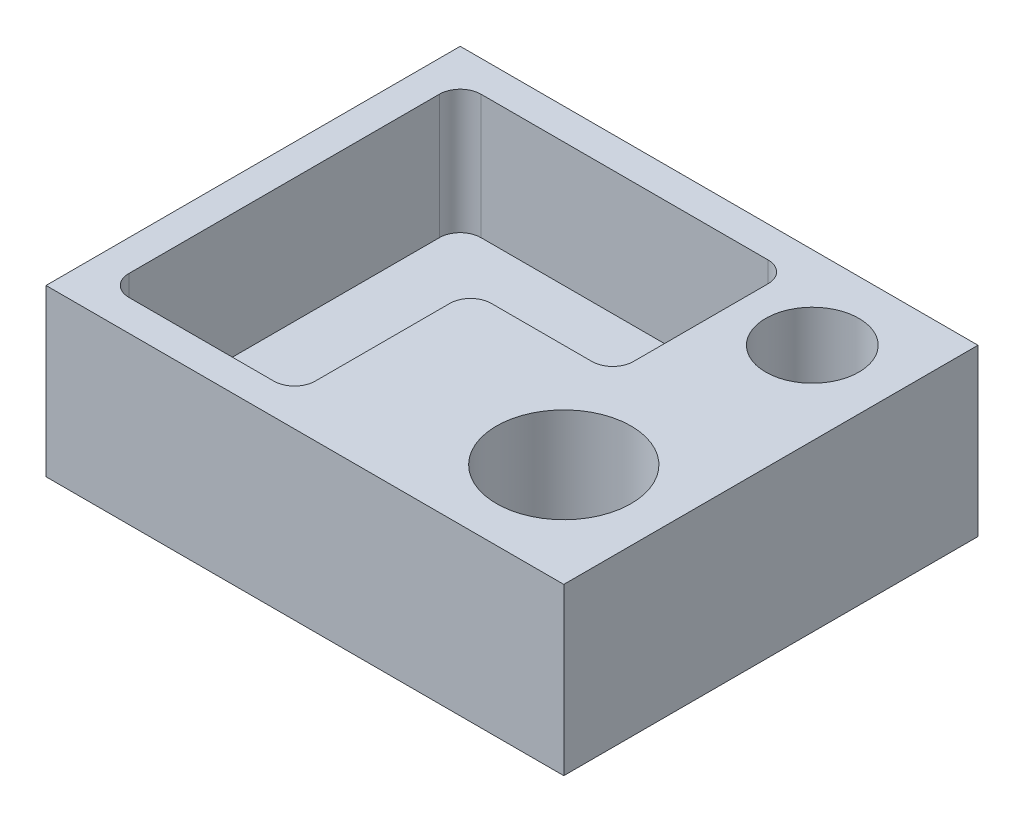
from build123d import *

# Parameters (mm, degrees)
SKETCH1_W           = 250
SKETCH1_H           = 200
BOSS_EXTRUDE1_DEPTH = 80
SKETCH2_R           = 22.5
SKETCH2_R_2         = 32.5
CUT_EXTRUDE1_DEPTH  = 60
FILLET1_R           = 10


with BuildPart() as part:
    # Sketch1 → Boss-Extrude1 (new body)
    with BuildSketch(Plane(origin=(0, 0, 0), x_dir=(1, 0, 0), z_dir=(0, 1, 0))):
        Rectangle(SKETCH1_W, SKETCH1_H)
    extrude(amount=BOSS_EXTRUDE1_DEPTH)

    # Sketch2 → Cut-Extrude1 (cut)
    with BuildSketch(Plane(origin=(0, 80, 0), x_dir=(1, 0, 0), z_dir=(0, 1, 0))):
        with Locations(Location((85, 60, 0), (0, 0, 270))):
            Circle(SKETCH2_R)
        with Locations(Location((75, -50, 0), (0, 0, 90))):
            Circle(SKETCH2_R_2)
        Polygon((-20, 85), (-110, 85), (-110, -85), (-20, -85), (-20, 0), (48.620656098, 0), (48.620656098, 85), align=None)
    extrude(amount=-CUT_EXTRUDE1_DEPTH, mode=Mode.SUBTRACT)

    # Fillet1
    fillet1_edges = [part.edges().sort_by_distance(p)[0] for p in [
        (-110, 50, 85),
        (-110, 50, -85),
        (48.620656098, 50, -85),
        (48.620656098, 50, 0),
        (-20, 50, 0),
        (-20, 50, 85),
    ]]
    fillet(fillet1_edges, radius=FILLET1_R)


solid = part.part
